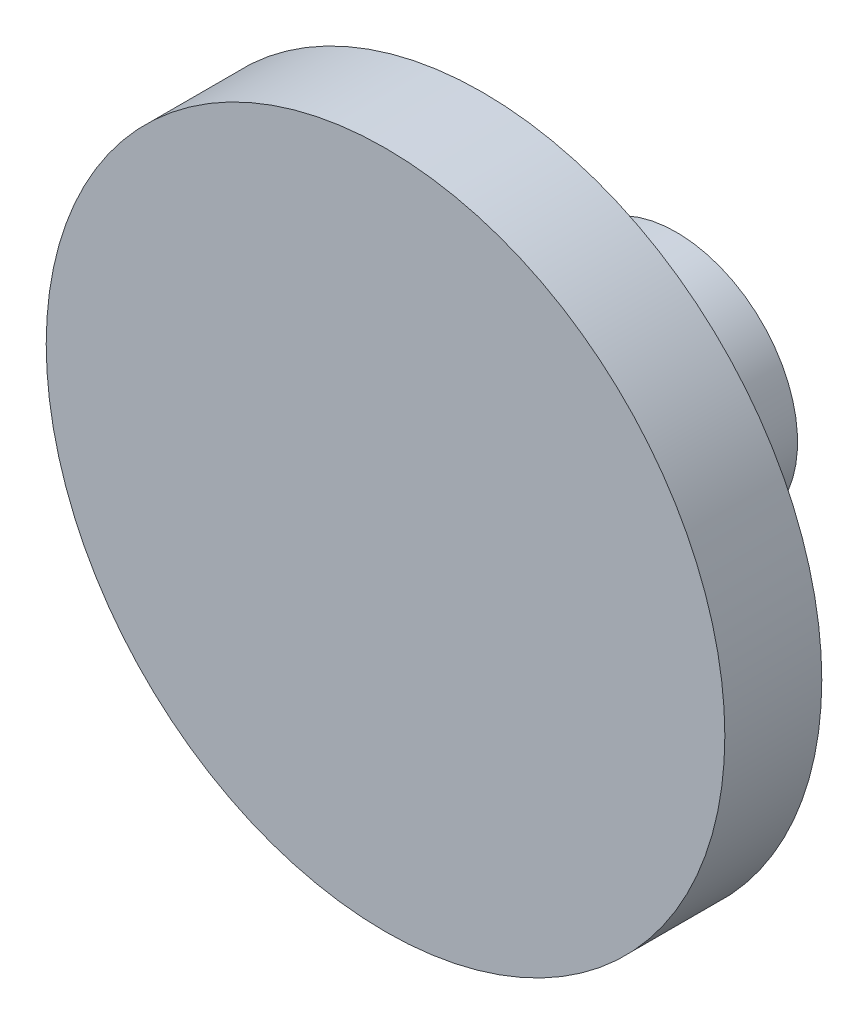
from build123d import *

# Parameters (mm, degrees)
SKETCH_1_W            = 21
SKETCH_1_H            = 6
SKETCH_3_R            = 7.5
EXTRUDE_2_DEPTH       = 12
HOLE_WIZARD_M61_D     = 5
HOLE_WIZARD_M61_DEPTH = 17.018
HOLE_WIZARD_M61_TIP   = 1.502151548


with BuildPart() as part:
    # Sketch 1 → Revolve 1 (revolve)
    with BuildSketch(Plane.XZ, mode=Mode.PRIVATE) as revolve_1_sk:
        with Locations((10.5, -6)):
            Rectangle(SKETCH_1_W, SKETCH_1_H)
    revolve(revolve_1_sk.sketch.rotate(Axis((0, 0, -3), (0, 0, -1)), 180), axis=Axis((0, 0, -3), (0, 0, -1)))

    # Sketch 3 → Extrude 2 (add)
    with BuildSketch(Plane(origin=(0, 0, -9), x_dir=(-1, 0, 0), z_dir=(0, 0, -1))):
        Circle(SKETCH_3_R)
    extrude(amount=EXTRUDE_2_DEPTH)

    # Hole Wizard M61
    with Locations(Plane(origin=(5.965012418, -4.546276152, -16.475317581), x_dir=(0.606170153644, 0.795334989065, 0), z_dir=(0.795334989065, -0.606170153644, 0))):
        with Locations((0, 0)):
            Hole(HOLE_WIZARD_M61_D / 2, depth=HOLE_WIZARD_M61_DEPTH)
            with Locations((0, 0, -(HOLE_WIZARD_M61_DEPTH + HOLE_WIZARD_M61_TIP / 2))):  # 118° drill point
                Cone(0, HOLE_WIZARD_M61_D / 2, HOLE_WIZARD_M61_TIP, mode=Mode.SUBTRACT)


solid = part.part
